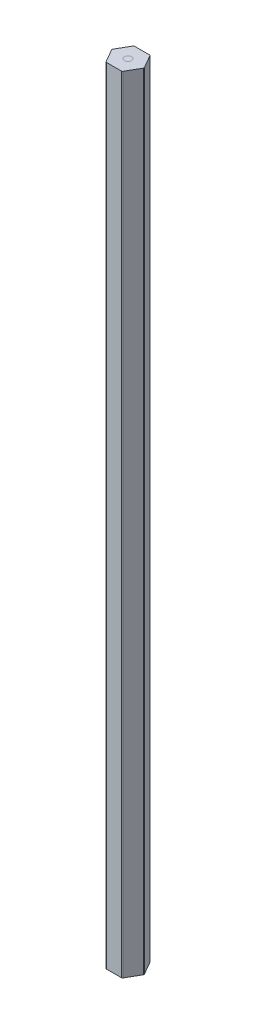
from build123d import *

# Parameters (mm, degrees)
SKETCH2_R      = 0.79375
EXTRUDE1_DEPTH = 177.8
SKETCH3_R      = 0.79375
EXTRUDE2_DEPTH = 177.8


with BuildPart() as part:
    # Sketch2 → Extrude1 (new body)
    with BuildSketch(Plane(origin=(0, 0, 0), x_dir=(1, 0, 0), z_dir=(0, 1, 0))):
        with BuildLine():
            Line((-1.906410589, 3.048), (-3.592850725, 0.127))
            ThreePointArc((-3.592850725, 0.127), (-3.626880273, 0), (-3.592850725, -0.127))
            Line((-3.592850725, -0.127), (-1.906410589, -3.048))
            ThreePointArc((-1.906410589, -3.048), (-1.813440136, -3.140970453), (-1.686440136, -3.175))
            Line((-1.686440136, -3.175), (1.686440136, -3.175))
            ThreePointArc((1.686440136, -3.175), (1.813440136, -3.140970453), (1.906410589, -3.048))
            Line((1.906410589, -3.048), (3.592850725, -0.127))
            ThreePointArc((3.592850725, -0.127), (3.626880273, 0), (3.592850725, 0.127))
            Line((3.592850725, 0.127), (1.906410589, 3.048))
            ThreePointArc((1.906410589, 3.048), (1.813440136, 3.140970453), (1.686440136, 3.175))
            Line((1.686440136, 3.175), (-1.686440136, 3.175))
            ThreePointArc((-1.686440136, 3.175), (-1.813440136, 3.140970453), (-1.906410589, 3.048))
        make_face()
        with Locations(Location((0, 0, 0), (0, 0, 270))):
            Circle(SKETCH2_R, mode=Mode.SUBTRACT)
    extrude(amount=EXTRUDE1_DEPTH)


with BuildPart() as body_2:
    # Sketch3 → Extrude2 (new body)
    with BuildSketch(Plane.XZ):
        with Locations(Location((0, 0, 0), (0, 0, 270))):
            Circle(SKETCH3_R)
    extrude(amount=-EXTRUDE2_DEPTH)


solid = Compound([part.part, body_2.part])
